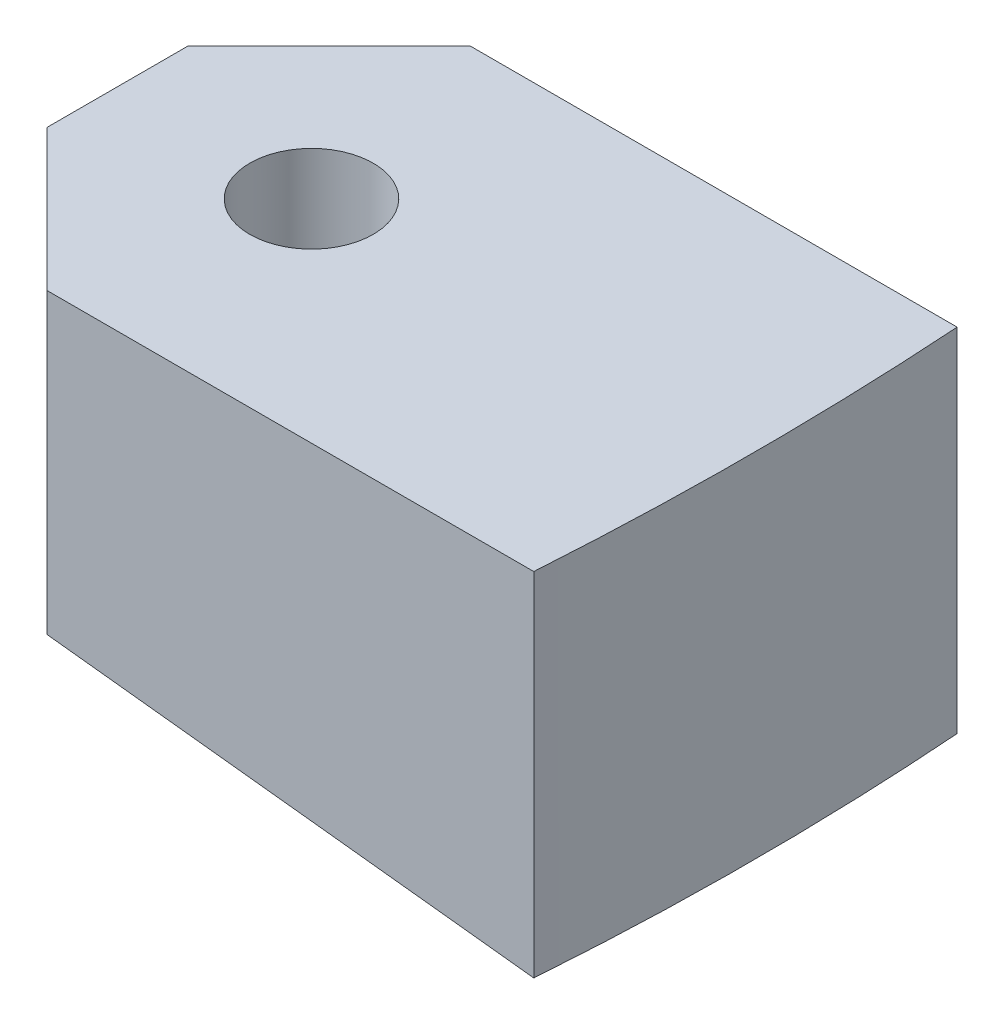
ISO-10303-21;
HEADER;
FILE_DESCRIPTION(('STEP AP214'),'2;1');
FILE_NAME('part.step','',(''),(''),'','','');
FILE_SCHEMA(('AUTOMOTIVE_DESIGN { 1 0 10303 214 1 1 1 1 }'));
ENDSEC;
DATA;
#1=APPLICATION_CONTEXT('core data for automotive mechanical design processes');
#2=APPLICATION_PROTOCOL_DEFINITION('international standard','automotive_design',2000,#1);
#3=PRODUCT_CONTEXT('',#1,'mechanical');
#4=PRODUCT('Part','Part','',(#3));
#5=PRODUCT_RELATED_PRODUCT_CATEGORY('part','',(#4));
#6=PRODUCT_DEFINITION_FORMATION('','',#4);
#7=PRODUCT_DEFINITION_CONTEXT('part definition',#1,'design');
#8=PRODUCT_DEFINITION('design','',#6,#7);
#9=PRODUCT_DEFINITION_SHAPE('','',#8);
#10=(LENGTH_UNIT() NAMED_UNIT(*) SI_UNIT(.MILLI.,.METRE.));
#11=(NAMED_UNIT(*) PLANE_ANGLE_UNIT() SI_UNIT($,.RADIAN.));
#12=(NAMED_UNIT(*) SI_UNIT($,.STERADIAN.) SOLID_ANGLE_UNIT());
#13=UNCERTAINTY_MEASURE_WITH_UNIT(LENGTH_MEASURE(1.E-05),#10,'distance_accuracy_value','');
#14=(GEOMETRIC_REPRESENTATION_CONTEXT(3) GLOBAL_UNCERTAINTY_ASSIGNED_CONTEXT((#13)) GLOBAL_UNIT_ASSIGNED_CONTEXT((#10,
#11,#12)) REPRESENTATION_CONTEXT('',''));
#15=CARTESIAN_POINT('',(0.,0.,0.));
#16=DIRECTION('',(0.,0.,1.));
#17=DIRECTION('',(1.,0.,0.));
#18=AXIS2_PLACEMENT_3D('',#15,#16,#17);
#19=CARTESIAN_POINT('',(90.,-50.,30.));
#20=DIRECTION('',(0.110431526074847,0.993883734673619,0.));
#21=DIRECTION('',(-0.993883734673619,0.110431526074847,0.));
#22=AXIS2_PLACEMENT_3D('',#19,#20,#21);
#23=PLANE('',#22);
#24=CARTESIAN_POINT('',(27.5,-43.0555555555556,0.));
#25=DIRECTION('',(0.110431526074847,0.993883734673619,0.));
#26=DIRECTION('',(-0.993883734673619,0.110431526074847,0.));
#27=AXIS2_PLACEMENT_3D('',#24,#25,#26);
#28=ELLIPSE('',#27,8.80384666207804,8.74999999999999);
#29=CARTESIAN_POINT('',(18.75,-42.0833333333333,0.));
#30=VERTEX_POINT('',#29);
#31=EDGE_CURVE('E101',#30,#30,#28,.T.);
#32=ORIENTED_EDGE('',*,*,#31,.T.);
#33=EDGE_LOOP('',(#32));
#34=FACE_BOUND('',#33,.T.);
#35=DIRECTION('',(0.,0.,-1.));
#36=VECTOR('',#35,1.);
#37=CARTESIAN_POINT('',(0.,-40.,30.));
#38=LINE('',#37,#36);
#39=CARTESIAN_POINT('',(0.,-40.,9.99999999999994));
#40=VERTEX_POINT('',#39);
#41=CARTESIAN_POINT('',(0.,-40.,-10.));
#42=VERTEX_POINT('',#41);
#43=EDGE_CURVE('E115',#40,#42,#38,.T.);
#44=ORIENTED_EDGE('',*,*,#43,.T.);
#45=DIRECTION('',(0.704934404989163,-0.0783260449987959,-0.70493440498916));
#46=VECTOR('',#45,1.);
#47=CARTESIAN_POINT('',(0.,-40.,-10.));
#48=LINE('',#47,#46);
#49=CARTESIAN_POINT('',(20.,-42.2222222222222,-30.));
#50=VERTEX_POINT('',#49);
#51=EDGE_CURVE('E132',#42,#50,#48,.T.);
#52=ORIENTED_EDGE('',*,*,#51,.T.);
#53=DIRECTION('',(0.993883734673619,-0.110431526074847,0.));
#54=VECTOR('',#53,1.);
#55=CARTESIAN_POINT('',(90.,-50.,-30.));
#56=LINE('',#55,#54);
#57=CARTESIAN_POINT('',(89.0044296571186,-49.8893810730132,-30.));
#58=VERTEX_POINT('',#57);
#59=EDGE_CURVE('E109',#50,#58,#56,.T.);
#60=ORIENTED_EDGE('',*,*,#59,.T.);
#61=CARTESIAN_POINT('',(-362.5,0.277777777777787,0.));
#62=DIRECTION('',(0.110431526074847,0.993883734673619,0.));
#63=DIRECTION('',(-0.993883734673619,0.110431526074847,0.));
#64=AXIS2_PLACEMENT_3D('',#61,#62,#63);
#65=ELLIPSE('',#64,455.284641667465,452.5);
#66=CARTESIAN_POINT('',(89.0044296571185,-49.8893810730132,30.));
#67=VERTEX_POINT('',#66);
#68=EDGE_CURVE('E100',#67,#58,#65,.T.);
#69=ORIENTED_EDGE('',*,*,#68,.F.);
#70=DIRECTION('',(0.993883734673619,-0.110431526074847,0.));
#71=VECTOR('',#70,1.);
#72=CARTESIAN_POINT('',(90.,-50.,30.));
#73=LINE('',#72,#71);
#74=CARTESIAN_POINT('',(20.,-42.2222222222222,30.));
#75=VERTEX_POINT('',#74);
#76=EDGE_CURVE('E108',#75,#67,#73,.T.);
#77=ORIENTED_EDGE('',*,*,#76,.F.);
#78=DIRECTION('',(0.70493440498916,-0.0783260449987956,0.704934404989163));
#79=VECTOR('',#78,1.);
#80=CARTESIAN_POINT('',(17.6687116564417,-41.9631901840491,27.6687116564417));
#81=LINE('',#80,#79);
#82=EDGE_CURVE('E130',#75,#40,#81,.F.);
#83=ORIENTED_EDGE('',*,*,#82,.T.);
#84=EDGE_LOOP('',(#44,#52,#60,#69,#77,#83));
#85=FACE_BOUND('',#84,.T.);
#86=ADVANCED_FACE('F35',(#34,#85),#23,.F.);
#87=CARTESIAN_POINT('',(0.,0.,30.));
#88=DIRECTION('',(0.,-1.,0.));
#89=DIRECTION('',(0.,0.,-1.));
#90=AXIS2_PLACEMENT_3D('',#87,#88,#89);
#91=PLANE('',#90);
#92=CARTESIAN_POINT('',(27.5,0.,0.));
#93=DIRECTION('',(0.,1.,0.));
#94=DIRECTION('',(0.,0.,1.));
#95=AXIS2_PLACEMENT_3D('',#92,#93,#94);
#96=CIRCLE('',#95,8.74999999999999);
#97=CARTESIAN_POINT('',(27.5,0.,8.74999999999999));
#98=VERTEX_POINT('',#97);
#99=EDGE_CURVE('E178',#98,#98,#96,.T.);
#100=ORIENTED_EDGE('',*,*,#99,.F.);
#101=EDGE_LOOP('',(#100));
#102=FACE_BOUND('',#101,.T.);
#103=DIRECTION('',(-1.,0.,0.));
#104=VECTOR('',#103,1.);
#105=CARTESIAN_POINT('',(0.,0.,-30.));
#106=LINE('',#105,#104);
#107=CARTESIAN_POINT('',(89.0044296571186,0.,-30.));
#108=VERTEX_POINT('',#107);
#109=CARTESIAN_POINT('',(20.0000000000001,0.,-30.));
#110=VERTEX_POINT('',#109);
#111=EDGE_CURVE('E117',#108,#110,#106,.T.);
#112=ORIENTED_EDGE('',*,*,#111,.T.);
#113=DIRECTION('',(-0.707106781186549,0.,0.707106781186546));
#114=VECTOR('',#113,1.);
#115=CARTESIAN_POINT('',(0.,0.,-10.));
#116=LINE('',#115,#114);
#117=CARTESIAN_POINT('',(0.,0.,-10.));
#118=VERTEX_POINT('',#117);
#119=EDGE_CURVE('E43',#110,#118,#116,.T.);
#120=ORIENTED_EDGE('',*,*,#119,.T.);
#121=DIRECTION('',(0.,0.,-1.));
#122=VECTOR('',#121,1.);
#123=CARTESIAN_POINT('',(0.,0.,30.));
#124=LINE('',#123,#122);
#125=CARTESIAN_POINT('',(0.,0.,9.99999999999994));
#126=VERTEX_POINT('',#125);
#127=EDGE_CURVE('E112',#126,#118,#124,.T.);
#128=ORIENTED_EDGE('',*,*,#127,.F.);
#129=DIRECTION('',(-0.707106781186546,0.,-0.707106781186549));
#130=VECTOR('',#129,1.);
#131=CARTESIAN_POINT('',(20.,0.,30.));
#132=LINE('',#131,#130);
#133=CARTESIAN_POINT('',(20.,0.,30.));
#134=VERTEX_POINT('',#133);
#135=EDGE_CURVE('E50',#126,#134,#132,.F.);
#136=ORIENTED_EDGE('',*,*,#135,.T.);
#137=DIRECTION('',(-1.,0.,0.));
#138=VECTOR('',#137,1.);
#139=CARTESIAN_POINT('',(0.,0.,30.));
#140=LINE('',#139,#138);
#141=CARTESIAN_POINT('',(89.0044296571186,0.,30.));
#142=VERTEX_POINT('',#141);
#143=EDGE_CURVE('E105',#142,#134,#140,.T.);
#144=ORIENTED_EDGE('',*,*,#143,.F.);
#145=CARTESIAN_POINT('',(-362.5,0.,0.));
#146=DIRECTION('',(0.,1.,0.));
#147=DIRECTION('',(0.,0.,1.));
#148=AXIS2_PLACEMENT_3D('',#145,#146,#147);
#149=CIRCLE('',#148,452.5);
#150=EDGE_CURVE('E92',#142,#108,#149,.T.);
#151=ORIENTED_EDGE('',*,*,#150,.T.);
#152=EDGE_LOOP('',(#112,#120,#128,#136,#144,#151));
#153=FACE_BOUND('',#152,.T.);
#154=ADVANCED_FACE('F111',(#102,#153),#91,.F.);
#155=CARTESIAN_POINT('',(0.,0.,30.));
#156=DIRECTION('',(0.,0.,-1.));
#157=DIRECTION('',(-1.,0.,0.));
#158=AXIS2_PLACEMENT_3D('',#155,#156,#157);
#159=PLANE('',#158);
#160=ORIENTED_EDGE('',*,*,#143,.T.);
#161=DIRECTION('',(0.,-1.,0.));
#162=VECTOR('',#161,1.);
#163=CARTESIAN_POINT('',(20.,0.,30.));
#164=LINE('',#163,#162);
#165=EDGE_CURVE('E11',#134,#75,#164,.T.);
#166=ORIENTED_EDGE('',*,*,#165,.T.);
#167=ORIENTED_EDGE('',*,*,#76,.T.);
#168=DIRECTION('',(0.,1.,0.));
#169=VECTOR('',#168,1.);
#170=CARTESIAN_POINT('',(89.0044296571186,-50.,30.));
#171=LINE('',#170,#169);
#172=EDGE_CURVE('E96',#142,#67,#171,.F.);
#173=ORIENTED_EDGE('',*,*,#172,.F.);
#174=EDGE_LOOP('',(#160,#166,#167,#173));
#175=FACE_BOUND('',#174,.T.);
#176=ADVANCED_FACE('F104',(#175),#159,.F.);
#177=CARTESIAN_POINT('',(0.,0.,-30.));
#178=DIRECTION('',(0.,0.,-1.));
#179=DIRECTION('',(-1.,0.,0.));
#180=AXIS2_PLACEMENT_3D('',#177,#178,#179);
#181=PLANE('',#180);
#182=ORIENTED_EDGE('',*,*,#59,.F.);
#183=DIRECTION('',(0.,1.,0.));
#184=VECTOR('',#183,1.);
#185=CARTESIAN_POINT('',(20.0000000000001,0.,-30.));
#186=LINE('',#185,#184);
#187=EDGE_CURVE('E58',#50,#110,#186,.T.);
#188=ORIENTED_EDGE('',*,*,#187,.T.);
#189=ORIENTED_EDGE('',*,*,#111,.F.);
#190=DIRECTION('',(0.,1.,0.));
#191=VECTOR('',#190,1.);
#192=CARTESIAN_POINT('',(89.0044296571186,-50.,-30.));
#193=LINE('',#192,#191);
#194=EDGE_CURVE('E99',#108,#58,#193,.F.);
#195=ORIENTED_EDGE('',*,*,#194,.T.);
#196=EDGE_LOOP('',(#182,#188,#189,#195));
#197=FACE_BOUND('',#196,.T.);
#198=ADVANCED_FACE('F144',(#197),#181,.T.);
#199=CARTESIAN_POINT('',(0.,-40.,30.));
#200=DIRECTION('',(1.,0.,0.));
#201=DIRECTION('',(0.,0.,-1.));
#202=AXIS2_PLACEMENT_3D('',#199,#200,#201);
#203=PLANE('',#202);
#204=ORIENTED_EDGE('',*,*,#127,.T.);
#205=DIRECTION('',(0.,-1.,0.));
#206=VECTOR('',#205,1.);
#207=CARTESIAN_POINT('',(0.,-40.,-10.));
#208=LINE('',#207,#206);
#209=EDGE_CURVE('E127',#118,#42,#208,.T.);
#210=ORIENTED_EDGE('',*,*,#209,.T.);
#211=ORIENTED_EDGE('',*,*,#43,.F.);
#212=DIRECTION('',(0.,1.,0.));
#213=VECTOR('',#212,1.);
#214=CARTESIAN_POINT('',(0.,-40.,9.99999999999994));
#215=LINE('',#214,#213);
#216=EDGE_CURVE('E125',#40,#126,#215,.T.);
#217=ORIENTED_EDGE('',*,*,#216,.T.);
#218=EDGE_LOOP('',(#204,#210,#211,#217));
#219=FACE_BOUND('',#218,.T.);
#220=ADVANCED_FACE('F139',(#219),#203,.F.);
#221=CARTESIAN_POINT('',(-362.5,-50.,0.));
#222=DIRECTION('',(0.,1.,0.));
#223=DIRECTION('',(0.,0.,1.));
#224=AXIS2_PLACEMENT_3D('',#221,#222,#223);
#225=CYLINDRICAL_SURFACE('',#224,452.5);
#226=ORIENTED_EDGE('',*,*,#68,.T.);
#227=ORIENTED_EDGE('',*,*,#194,.F.);
#228=ORIENTED_EDGE('',*,*,#150,.F.);
#229=ORIENTED_EDGE('',*,*,#172,.T.);
#230=EDGE_LOOP('',(#226,#227,#228,#229));
#231=FACE_BOUND('',#230,.T.);
#232=ADVANCED_FACE('F95',(#231),#225,.T.);
#233=CARTESIAN_POINT('',(27.5,0.,0.));
#234=DIRECTION('',(0.,1.,0.));
#235=DIRECTION('',(0.,0.,1.));
#236=AXIS2_PLACEMENT_3D('',#233,#234,#235);
#237=CYLINDRICAL_SURFACE('',#236,8.74999999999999);
#238=ORIENTED_EDGE('',*,*,#99,.T.);
#239=EDGE_LOOP('',(#238));
#240=FACE_BOUND('',#239,.T.);
#241=ORIENTED_EDGE('',*,*,#31,.F.);
#242=EDGE_LOOP('',(#241));
#243=FACE_BOUND('',#242,.T.);
#244=ADVANCED_FACE('F163',(#240,#243),#237,.F.);
#245=CARTESIAN_POINT('',(0.,-40.,-10.));
#246=DIRECTION('',(-0.707106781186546,0.,-0.707106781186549));
#247=DIRECTION('',(0.,1.,0.));
#248=AXIS2_PLACEMENT_3D('',#245,#246,#247);
#249=PLANE('',#248);
#250=ORIENTED_EDGE('',*,*,#119,.F.);
#251=ORIENTED_EDGE('',*,*,#187,.F.);
#252=ORIENTED_EDGE('',*,*,#51,.F.);
#253=ORIENTED_EDGE('',*,*,#209,.F.);
#254=EDGE_LOOP('',(#250,#251,#252,#253));
#255=FACE_BOUND('',#254,.T.);
#256=ADVANCED_FACE('F142',(#255),#249,.T.);
#257=CARTESIAN_POINT('',(20.,0.,30.));
#258=DIRECTION('',(0.707106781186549,0.,-0.707106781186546));
#259=DIRECTION('',(0.,-1.,0.));
#260=AXIS2_PLACEMENT_3D('',#257,#258,#259);
#261=PLANE('',#260);
#262=ORIENTED_EDGE('',*,*,#135,.F.);
#263=ORIENTED_EDGE('',*,*,#216,.F.);
#264=ORIENTED_EDGE('',*,*,#82,.F.);
#265=ORIENTED_EDGE('',*,*,#165,.F.);
#266=EDGE_LOOP('',(#262,#263,#264,#265));
#267=FACE_BOUND('',#266,.T.);
#268=ADVANCED_FACE('F37',(#267),#261,.F.);
#269=CLOSED_SHELL('',(#86,#154,#176,#198,#220,#232,#244,#256,#268));
#270=MANIFOLD_SOLID_BREP('B2',#269);
#271=ADVANCED_BREP_SHAPE_REPRESENTATION('',(#18,#270),#14);
#272=SHAPE_DEFINITION_REPRESENTATION(#9,#271);
ENDSEC;
END-ISO-10303-21;
